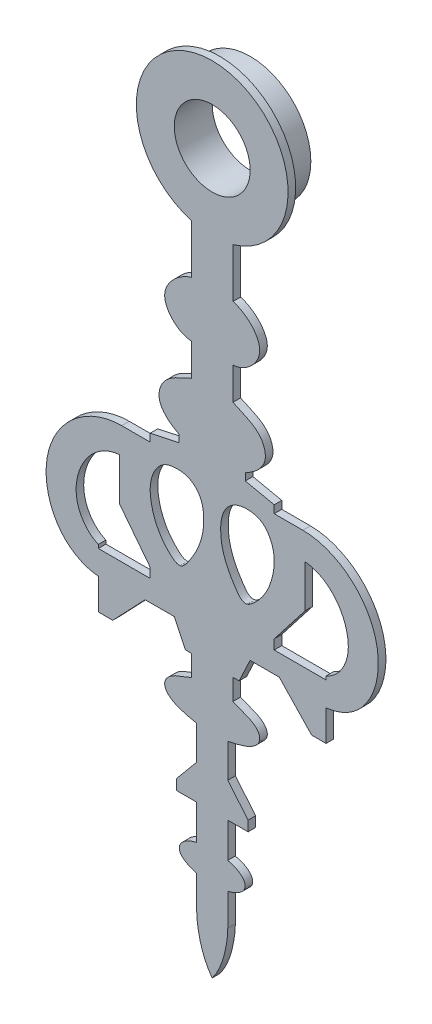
from build123d import *
from build123d.topology import SkipClean

# Parameters (mm, degrees)
SKETCH_1_R      = 5
EXTRUDE_1_DEPTH = 1
EXTRUDE_START   = 4
SKETCH_2_R      = 8
SKETCH_2_R_2    = 5
EXTRUDE_2_DEPTH = 4


with BuildPart() as part:
    # Sketch 1 → Extrude 1 (new body)
    with BuildSketch(Plane.XY):
        with BuildLine():
            add(Edge.make_bspline(
                [(2.735, 19.130524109), (4.356974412, 19.150873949), (8.240153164, 22.682926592), (4.207155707, 26.043520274), (2.735, 26.381279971)],
                knots=[0, 0, 0, 0, 0.492043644, 1, 1, 1, 1], degree=3))
            Line((2.735, 26.381279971), (2.735, 32.881279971))
            ThreePointArc((2.735, 32.881279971), (0, 52.5), (-2.735, 32.881279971))
            Line((-2.735, 32.881279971), (-2.735, 26.381279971))
            add(Edge.make_bspline(
                [(-2.735, 19.130524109), (-4.356974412, 19.150873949), (-8.240153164, 22.682926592), (-4.207155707, 26.043520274), (-2.735, 26.381279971)],
                knots=[0, 0, 0, 0, 0.492043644, 1, 1, 1, 1], degree=3))
            Line((-2.735, 19.130524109), (-2.735, 14.880524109))
            add(Edge.make_bspline(
                [(-4.3568, 7.662710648), (-5.170846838, 8.083756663), (-6.297950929, 8.840790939), (-7.058490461, 10.375396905), (-6.987152, 11.520743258), (-6.516149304, 12.61880542), (-5.120135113, 13.93352951), (-3.672041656, 14.414415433), (-2.735, 14.880524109)],
                knots=[0, 0, 0, 0, 0.262865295, 0.368853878, 0.468953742, 0.577987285, 0.700614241, 1, 1, 1, 1], degree=3))
            Line((-4.3568, 7.662710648), (-4.3568, 6.710210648))
            Line((-4.3568, 6.710210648), (-8.1668, 5.898810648))
            Line((-8.1668, 5.898810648), (-8.1668, 4.875810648))
            Line((-8.1668, 4.875810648), (-11.9415, 4.875810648))
            add(Edge.make_bspline(
                [(-11.9415, 4.875810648), (-14.341318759, 4.875810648), (-18.954027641, 2.900788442), (-23.690992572, -5.523794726), (-20.176019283, -13.29902997), (-15.0106, -13.856689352)],
                knots=[0, 0, 0, 0, 0.259028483, 0.508660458, 1, 1, 1, 1], degree=3))
            Line((-15.0106, -13.856689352), (-15.0106, -17.927875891))
            Line((-15.0106, -17.927875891), (-13.1058, -17.927875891))
            Line((-13.1058, -17.927875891), (-8.8372, -13.447575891))
            Line((-8.8372, -13.447575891), (-4.9919, -13.447575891))
            Line((-4.9919, -13.447575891), (-3.5455, -16.516775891))
            Line((-3.5455, -16.516775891), (-2.735, -16.516775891))
            Line((-2.735, -16.516775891), (-2.735, -19.268375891))
            add(Edge.make_bspline(
                [(-2.735, -19.268375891), (-3.699799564, -19.757220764), (-5.167737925, -19.980196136), (-6.255035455, -21.260137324), (-6.304731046, -22.114655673), (-5.741557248, -22.858628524), (-4.336095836, -23.689781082), (-2.993598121, -23.959429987), (-2.05, -24.157789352)],
                knots=[0, 0, 0, 0, 0.338643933, 0.424709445, 0.497744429, 0.58473251, 0.698034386, 1, 1, 1, 1], degree=3))
            Line((-2.05, -24.157789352), (-2.05, -28.602789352))
            Line((-2.05, -28.602789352), (-4.7311, -31.813089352))
            Line((-4.7311, -31.813089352), (-4.7311, -33.153689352))
            Line((-4.7311, -33.153689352), (-2.05, -33.153689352))
            Line((-2.05, -33.153689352), (-2.05, -37.7522))
            add(Edge.make_bspline(
                [(-2.05, -37.7522), (-2.737778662, -37.916286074), (-3.715453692, -38.246382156), (-4.408659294, -39.30113119), (-4.267430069, -40.113229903), (-3.394712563, -40.827385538), (-2.605326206, -41.139906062), (-2.05, -41.28)],
                knots=[0, 0, 0, 0, 0.353500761, 0.472036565, 0.582770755, 0.721161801, 1, 1, 1, 1], degree=3))
            Line((-2.05, -41.28), (-2.05, -45.5133))
            add(Edge.make_bspline(
                [(0, -52.2), (-0.705020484, -51.267326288), (-1.424177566, -49.637589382), (-1.916732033, -47.310937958), (-2.05, -46.131426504), (-2.05, -45.5133)],
                knots=[0, 0, 0, 0, 0.490623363, 0.745278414, 1, 1, 1, 1], degree=3))
            add(Edge.make_bspline(
                [(0, -52.2), (0.705020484, -51.267326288), (1.424177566, -49.637589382), (1.916732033, -47.310937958), (2.05, -46.131426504), (2.05, -45.5133)],
                knots=[0, 0, 0, 0, 0.490623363, 0.745278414, 1, 1, 1, 1], degree=3))
            Line((2.05, -45.5133), (2.05, -41.28))
            add(Edge.make_bspline(
                [(2.05, -37.7522), (2.737778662, -37.916286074), (3.715453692, -38.246382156), (4.408659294, -39.30113119), (4.267430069, -40.113229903), (3.394712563, -40.827385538), (2.605326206, -41.139906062), (2.05, -41.28)],
                knots=[0, 0, 0, 0, 0.353500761, 0.472036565, 0.582770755, 0.721161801, 1, 1, 1, 1], degree=3))
            Line((2.05, -37.7522), (2.05, -33.153689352))
            Line((2.05, -33.153689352), (4.7311, -33.153689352))
            Line((4.7311, -33.153689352), (4.7311, -31.813089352))
            Line((4.7311, -31.813089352), (2.05, -28.602789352))
            Line((2.05, -28.602789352), (2.05, -24.157789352))
            add(Edge.make_bspline(
                [(2.735, -19.268375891), (3.699799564, -19.757220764), (5.167737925, -19.980196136), (6.255035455, -21.260137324), (6.304731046, -22.114655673), (5.741557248, -22.858628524), (4.336095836, -23.689781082), (2.993598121, -23.959429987), (2.05, -24.157789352)],
                knots=[0, 0, 0, 0, 0.338643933, 0.424709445, 0.497744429, 0.58473251, 0.698034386, 1, 1, 1, 1], degree=3))
            Line((2.735, -19.268375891), (2.735, -16.516775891))
            Line((2.735, -16.516775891), (3.5455, -16.516775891))
            Line((3.5455, -16.516775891), (4.9919, -13.447575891))
            Line((4.9919, -13.447575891), (8.8372, -13.447575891))
            Line((8.8372, -13.447575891), (13.1058, -17.927875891))
            Line((13.1058, -17.927875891), (15.0106, -17.927875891))
            Line((15.0106, -17.927875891), (15.0106, -13.856689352))
            add(Edge.make_bspline(
                [(11.9415, 4.875810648), (14.341318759, 4.875810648), (18.954027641, 2.900788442), (23.690992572, -5.523794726), (20.176019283, -13.29902997), (15.0106, -13.856689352)],
                knots=[0, 0, 0, 0, 0.259028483, 0.508660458, 1, 1, 1, 1], degree=3))
            Line((11.9415, 4.875810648), (8.1668, 4.875810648))
            Line((8.1668, 4.875810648), (8.1668, 5.898810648))
            Line((8.1668, 5.898810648), (4.3568, 6.710210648))
            Line((4.3568, 6.710210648), (4.3568, 7.662710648))
            add(Edge.make_bspline(
                [(4.3568, 7.662710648), (5.170846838, 8.083756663), (6.297950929, 8.840790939), (7.058490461, 10.375396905), (6.987152, 11.520743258), (6.516149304, 12.61880542), (5.120135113, 13.93352951), (3.672041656, 14.414415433), (2.735, 14.880524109)],
                knots=[0, 0, 0, 0, 0.262865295, 0.368853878, 0.468953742, 0.577987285, 0.700614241, 1, 1, 1, 1], degree=3))
            Line((2.735, 14.880524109), (2.735, 19.130524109))
        make_face()
        with BuildLine():
            Line((-15.0106, -10.6797), (-15.0106, -10.2211))
            add(Edge.make_bspline(
                [(-12.2237, 1.4205), (-13.992630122, 1.291716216), (-16.284291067, -0.288382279), (-17.790127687, -3.42831104), (-18.206224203, -6.960950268), (-16.694043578, -9.478424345), (-15.0106, -10.2211)],
                knots=[0, 0, 0, 0, 0.330322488, 0.496737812, 0.660859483, 1, 1, 1, 1], degree=3))
            Line((-12.2237, 1.4205), (-12.2237, -4.1886))
            Line((-12.2237, -4.1886), (-8.1668, -9.4097))
            Line((-8.1668, -9.4097), (-8.1668, -10.6797))
            Line((-8.1668, -10.6797), (-15.0106, -10.6797))
        make_face(mode=Mode.SUBTRACT)
        with BuildLine():
            add(Edge.make_bspline(
                [(-4.639, 3.6078), (-5.260732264, 3.604479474), (-6.481564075, 3.383936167), (-7.805760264, 1.803319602), (-8.311015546, -0.268074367), (-7.8763905, -3.307826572), (-6.698364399, -5.673538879), (-4.227059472, -7.752667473), (-1.939068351, -4.697434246), (-0.828085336, -1.702095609), (-1.31844107, 1.872389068), (-2.811118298, 3.403543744), (-4.019979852, 3.611106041), (-4.639, 3.6078)],
                knots=[0, 0, 0, 0, 0.064975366, 0.126683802, 0.209139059, 0.287979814, 0.448635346, 0.508667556, 0.568592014, 0.784772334, 0.872763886, 0.935308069, 1, 1, 1, 1], degree=3))
        make_face(mode=Mode.SUBTRACT)
        with BuildLine():
            add(Edge.make_bspline(
                [(4.639, 3.6078), (5.260732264, 3.604479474), (6.481564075, 3.383936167), (7.805760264, 1.803319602), (8.311015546, -0.268074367), (7.8763905, -3.307826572), (6.698364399, -5.673538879), (4.227059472, -7.752667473), (1.939068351, -4.697434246), (0.828085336, -1.702095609), (1.31844107, 1.872389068), (2.811118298, 3.403543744), (4.019979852, 3.611106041), (4.639, 3.6078)],
                knots=[0, 0, 0, 0, 0.064975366, 0.126683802, 0.209139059, 0.287979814, 0.448635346, 0.508667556, 0.568592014, 0.784772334, 0.872763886, 0.935308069, 1, 1, 1, 1], degree=3))
        make_face(mode=Mode.SUBTRACT)
        with BuildLine():
            add(Edge.make_bspline(
                [(12.2237, 1.4205), (13.992630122, 1.291716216), (16.284291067, -0.288382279), (17.790127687, -3.42831104), (18.206224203, -6.960950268), (16.694043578, -9.478424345), (15.0106, -10.2211)],
                knots=[0, 0, 0, 0, 0.330322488, 0.496737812, 0.660859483, 1, 1, 1, 1], degree=3))
            Line((15.0106, -10.2211), (15.0106, -10.6797))
            Line((15.0106, -10.6797), (8.1668, -10.6797))
            Line((8.1668, -10.6797), (8.1668, -9.4097))
            Line((8.1668, -9.4097), (12.2237, -4.1886))
            Line((12.2237, -4.1886), (12.2237, 1.4205))
        make_face(mode=Mode.SUBTRACT)
        with Locations((0, 42.5)):
            Circle(SKETCH_1_R, mode=Mode.SUBTRACT)
    extrude(amount=EXTRUDE_1_DEPTH)

    # Sketch 2 → Extrude 2 (add)
    with SkipClean():  # the faces are left unmerged after this step: merging them gives an invalid solid
        with BuildSketch(Plane(origin=(0, 0, 0), x_dir=(-1, 0, 0), z_dir=(0, 0, -1)).offset(EXTRUDE_START)):
            with Locations(Location((0, 42.5, 0), (0, 0, 180))):
                Circle(SKETCH_2_R)
            with Locations((0, 42.5)):
                Circle(SKETCH_2_R_2, mode=Mode.SUBTRACT)
        extrude(amount=-EXTRUDE_2_DEPTH)


solid = part.part
